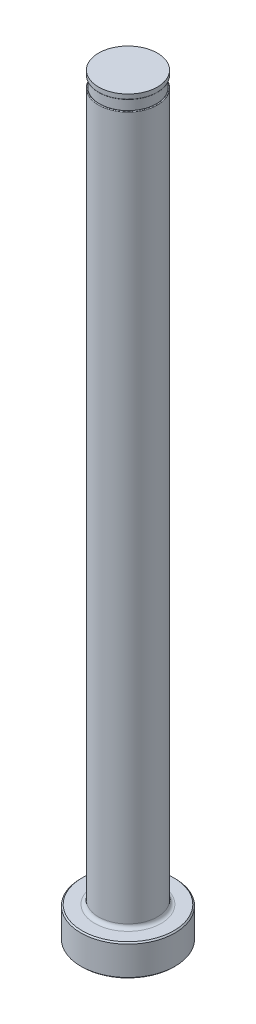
from build123d import *

# Parameters (mm, degrees)
CHAMFER1_SIZE     = 0.254
FILLET1_R         = 0.762
SKETCH2_W         = 0.2032
SKETCH2_H         = 2.032
D_SLOT_DEPTH      = 153.9941543
D_SLOT_DEPTH_BACK = 153.9941543
SKETCH5_W         = 0.00508
SKETCH5_H         = 1.016
FILLET2_R         = 0.127


with BuildPart() as part:
    # Sketch1 → Revolve1 (revolve)
    with BuildSketch(Plane.XY, mode=Mode.PRIVATE) as revolve1_sk:
        Polygon((0, 0), (-9.525, 0), (-9.525, 6.35), (-5.95249, 6.35), (-5.95249, 152.4), (0, 152.4), align=None)
    revolve(revolve1_sk.sketch.rotate(Axis((0, 259.958771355, 0), (0, -1, 0)), 270), axis=Axis((0, 259.958771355, 0), (0, -1, 0)))

    # Chamfer1
    chamfer1_edges = [part.edges().sort_by_distance(p)[0] for p in [
        (0, 6.35, -9.525),
        (0, 0, -9.525),
    ]]
    chamfer(chamfer1_edges, length=CHAMFER1_SIZE)

    # Fillet1
    fillet1_edges = [part.edges().sort_by_distance(p)[0] for p in [
        (0, 6.35, -5.95249),
    ]]
    fillet(fillet1_edges, radius=FILLET1_R)

    # Sketch2 → Vent Relief (revolve, cut)
    with BuildSketch(Plane.XY, mode=Mode.PRIVATE) as vent_relief_sk:
        with Locations((-5.85089, 150.368)):
            Rectangle(SKETCH2_W, SKETCH2_H)
    revolve(vent_relief_sk.sketch.rotate(Axis((0, 153.448281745, 0), (0, -1, 0)), 270), axis=Axis((0, 153.448281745, 0), (0, -1, 0)), mode=Mode.SUBTRACT)

    # Sketch3 → D-Slot (cut, two sides: drawn at the far end of the back side and taken through both)
    with BuildSketch(Plane.XY.offset(-D_SLOT_DEPTH_BACK)):
        with BuildLine():
            Line((-5.74929, 150.368), (-5.74929, 86.868))
            ThreePointArc((-5.74929, 86.868), (-5.800503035, 86.300038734), (-5.95249, 85.7504))
            Line((-5.95249, 85.7504), (-5.95249, 150.368))
            Line((-5.95249, 150.368), (-5.74929, 150.368))
        make_face()
    extrude(amount=D_SLOT_DEPTH + D_SLOT_DEPTH_BACK, mode=Mode.SUBTRACT)

    # Sketch5 → Vent Diameter (revolve, cut)
    with BuildSketch(Plane.XY, mode=Mode.PRIVATE) as vent_diameter_sk:
        with Locations((-5.94995, 151.892)):
            Rectangle(SKETCH5_W, SKETCH5_H)
    revolve(vent_diameter_sk.sketch.rotate(Axis((0, 152.687735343, 0), (0, -1, 0)), 90), axis=Axis((0, 152.687735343, 0), (0, -1, 0)), mode=Mode.SUBTRACT)

    # Fillet2
    fillet2_edges = [part.edges().sort_by_distance(p)[0] for p in [
        (4.722867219, 149.352, -3.623073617),
        (0, 151.384, 5.94741),
    ]]
    fillet(fillet2_edges, radius=FILLET2_R)


solid = part.part
